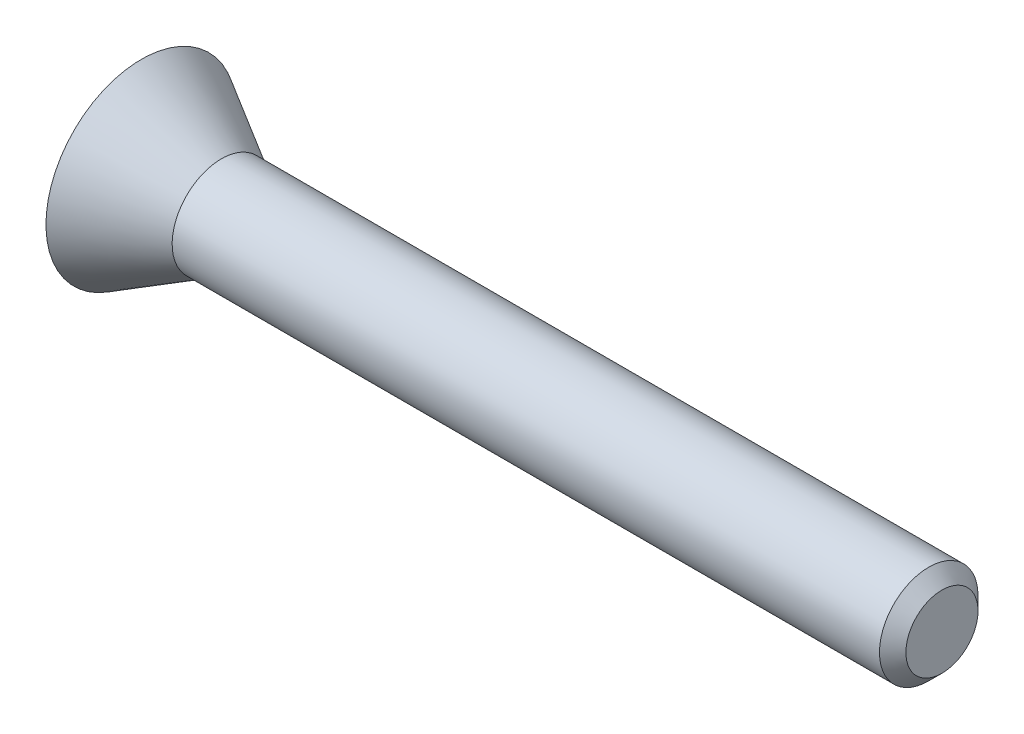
from build123d import *

# Parameters (mm, degrees)
SKETCH1_R           = 1.55
BOSS_EXTRUDE1_DEPTH = 6.5
CUT_EXTRUDE1_DEPTH  = 0.4
CHAMFER1_SIZE       = 0.2145
CUT_EXTRUDE2_DEPTH  = 0.4


with BuildPart() as part:
    # Sketch1 → Boss-Extrude1 (new, symmetric)
    with BuildSketch(Plane(origin=(0, 0, 0), x_dir=(0, 0, -1), z_dir=(1, 0, 0))):
        with Locations(Location((0, 0, 0), (0, 0, 180))):
            Circle(SKETCH1_R)
    extrude(amount=BOSS_EXTRUDE1_DEPTH, both=True)

    # Sketch2 → Cut-Revolve1 (revolve, cut)
    with BuildSketch(Plane.XY, mode=Mode.PRIVATE) as cut_revolve1_sk:
        Polygon((-5.200961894, 0.8), (6.5, 0.8), (6.5, 1.55), (-6.5, 1.55), align=None)
    revolve(cut_revolve1_sk.sketch.rotate(Axis((-6.5, 0, 0), (1, 0, 0)), 180), axis=Axis((-6.5, 0, 0), (1, 0, 0)), mode=Mode.SUBTRACT)

    # Sketch3 → Cut-Extrude1 (cut)
    with BuildSketch(Plane.ZY.offset(6.5)):
        with BuildLine():
            Line((0.155, 0.68), (0.155, -1.025))
            ThreePointArc((0.155, -1.025), (0, -1.18), (-0.155, -1.025))
            Line((-0.155, -1.025), (-0.155, 0.68))
            Line((-0.155, 0.68), (-0.37, 0.68))
            Line((-0.37, 0.68), (0, 1.3))
            Line((0, 1.3), (0.37, 0.68))
            Line((0.37, 0.68), (0.155, 0.68))
        make_face()
    extrude(amount=-CUT_EXTRUDE1_DEPTH, mode=Mode.SUBTRACT)

    # Chamfer1
    chamfer1_edges = [part.edges().sort_by_distance(p)[0] for p in [
        (6.5, 0.8, 0),
    ]]
    chamfer(chamfer1_edges, length=CHAMFER1_SIZE)

    # Sketch4 → Cut-Extrude2 (cut)
    with BuildSketch(Plane.ZY.offset(6.5)):
        with BuildLine():
            Line((1.022085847, -0.75), (1.022085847, -0.545941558))
            Line((1.022085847, -0.545941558), (0.612020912, -0.002678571))
            add(Edge.make_bspline(
                [(0.612020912, -0.002678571), (0.60343203, 0.009423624), (0.586696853, 0.033004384), (0.571550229, 0.065387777), (0.562114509, 0.090776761), (0.557617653, 0.109188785), (0.554409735, 0.126755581), (0.554014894, 0.138298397), (0.55382286, 0.143912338)],
                knots=[0, 0, 0, 0, 1.664252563, 3.24274559, 3.998498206, 4.704056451, 5.369707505, 6, 6, 6, 6], degree=3))
            Line((0.55382286, 0.143912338), (0.55382286, 0.145616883))
            add(Edge.make_bspline(
                [(0.55382286, 0.145616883), (0.554155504, 0.153289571), (0.554792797, 0.167989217), (0.560797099, 0.188701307), (0.570637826, 0.206738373), (0.584732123, 0.221636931), (0.602278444, 0.233420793), (0.623273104, 0.241725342), (0.647441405, 0.246487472), (0.664595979, 0.24708696), (0.673628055, 0.247402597)],
                knots=[0, 0, 0, 0, 1.029992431, 1.973301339, 2.872554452, 3.768620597, 4.704316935, 5.693697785, 6.785705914, 8, 8, 8, 8], degree=3))
            add(Edge.make_bspline(
                [(0.673628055, 0.247402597), (0.682449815, 0.247058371), (0.699590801, 0.246389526), (0.723856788, 0.238976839), (0.745722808, 0.227349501), (0.764573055, 0.210758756), (0.780182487, 0.189928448), (0.792851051, 0.165399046), (0.801455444, 0.136727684), (0.804499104, 0.116203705), (0.806095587, 0.105438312)],
                knots=[0, 0, 0, 0, 0.980828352, 1.905783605, 2.800718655, 3.724477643, 4.680224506, 5.688112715, 6.78735127, 8, 8, 8, 8], degree=3))
            Line((0.806095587, 0.105438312), (1.036939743, 0.104707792))
            add(Edge.make_bspline(
                [(1.036939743, 0.104707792), (1.035800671, 0.119348), (1.033577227, 0.146499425), (1.026287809, 0.185775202), (1.016866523, 0.222770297), (1.004881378, 0.257477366), (0.989480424, 0.28949454), (0.972176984, 0.31949113), (0.951365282, 0.346539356), (0.928583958, 0.371544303), (0.903209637, 0.393568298), (0.876153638, 0.412996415), (0.847006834, 0.429163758), (0.816212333, 0.442575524), (0.783428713, 0.452754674), (0.749084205, 0.460379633), (0.7127846, 0.464776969), (0.6880067, 0.465311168), (0.6753326, 0.465584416)],
                knots=[0, 0, 0, 0, 1.173229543, 2.290119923, 3.354877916, 4.382703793, 5.372196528, 6.339367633, 7.289741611, 8.236749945, 9.180232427, 10.11040526, 11.033485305, 11.978374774, 12.930610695, 13.916256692, 14.93414813, 16, 16, 16, 16], degree=3))
            add(Edge.make_bspline(
                [(0.6753326, 0.465584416), (0.661685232, 0.465390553), (0.635142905, 0.465013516), (0.59650187, 0.46094352), (0.560144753, 0.454800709), (0.526130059, 0.445814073), (0.494594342, 0.434091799), (0.465443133, 0.419957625), (0.438615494, 0.403291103), (0.414316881, 0.384056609), (0.392454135, 0.362603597), (0.373636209, 0.338714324), (0.357346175, 0.312871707), (0.344612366, 0.284574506), (0.334128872, 0.254488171), (0.327340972, 0.222073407), (0.322766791, 0.18771186), (0.32226274, 0.164058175), (0.322004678, 0.151948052)],
                knots=[0, 0, 0, 0, 1.219700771, 2.37215663, 3.469774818, 4.513610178, 5.512457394, 6.473141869, 7.405450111, 8.330272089, 9.238546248, 10.1372905, 11.043445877, 11.962355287, 12.905558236, 13.886315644, 14.917844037, 16, 16, 16, 16], degree=3))
            add(Edge.make_bspline(
                [(0.322004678, 0.151948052), (0.322315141, 0.137320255), (0.322936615, 0.109988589), (0.328546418, 0.069082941), (0.337586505, 0.028386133), (0.350001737, -0.011905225), (0.365424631, -0.051093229), (0.38393507, -0.088641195), (0.404826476, -0.12456574), (0.421381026, -0.146737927), (0.429634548, -0.157792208)],
                knots=[0, 0, 0, 0, 0.984368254, 1.970475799, 2.971844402, 3.988480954, 5.008197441, 6.005725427, 7.005724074, 8, 8, 8, 8], degree=3))
            Line((0.429634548, -0.157792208), (0.723790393, -0.531818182))
            Line((0.723790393, -0.531818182), (0.315430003, -0.531818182))
            Line((0.315430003, -0.531818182), (0.315430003, -0.75))
            Line((0.315430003, -0.75), (1.022085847, -0.75))
        make_face()
        Polygon((-0.994683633, 0.45), (-0.994683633, 0.299512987), (-0.72682649, -0.75), (-0.482832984, -0.75), (-0.742410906, 0.231818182), (-0.537134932, 0.231818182), (-0.537134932, 0.044805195), (-0.311891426, 0.044805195), (-0.311891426, 0.45), align=None)
    extrude(amount=-CUT_EXTRUDE2_DEPTH, mode=Mode.SUBTRACT)


solid = part.part
